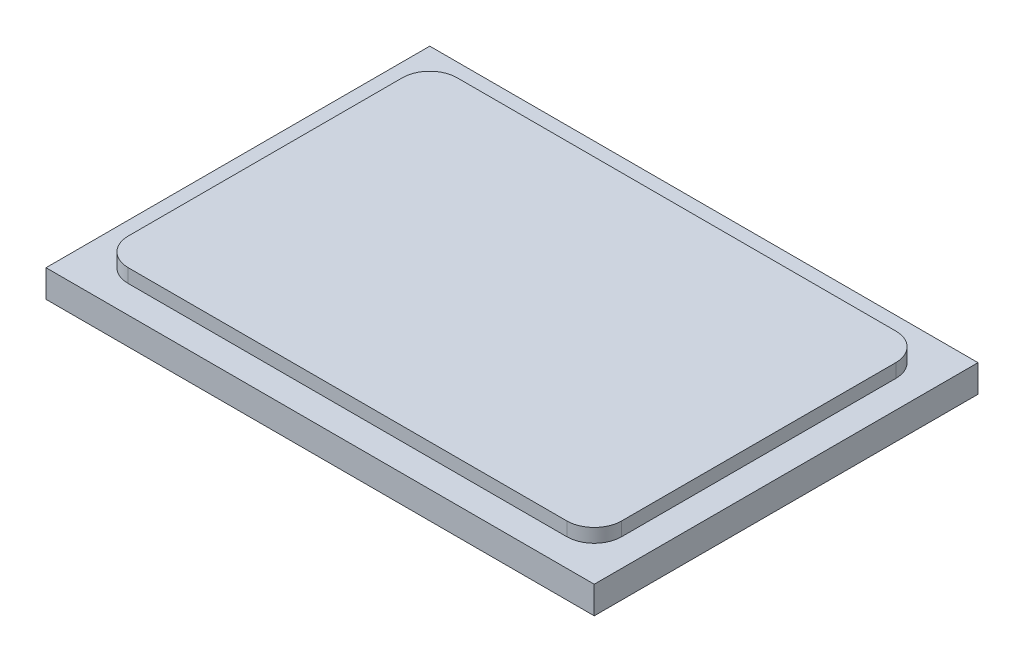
ISO-10303-21;
HEADER;
FILE_DESCRIPTION(('STEP AP214'),'2;1');
FILE_NAME('part.step','',(''),(''),'','','');
FILE_SCHEMA(('AUTOMOTIVE_DESIGN { 1 0 10303 214 1 1 1 1 }'));
ENDSEC;
DATA;
#1=APPLICATION_CONTEXT('core data for automotive mechanical design processes');
#2=APPLICATION_PROTOCOL_DEFINITION('international standard','automotive_design',2000,#1);
#3=PRODUCT_CONTEXT('',#1,'mechanical');
#4=PRODUCT('Part','Part','',(#3));
#5=PRODUCT_RELATED_PRODUCT_CATEGORY('part','',(#4));
#6=PRODUCT_DEFINITION_FORMATION('','',#4);
#7=PRODUCT_DEFINITION_CONTEXT('part definition',#1,'design');
#8=PRODUCT_DEFINITION('design','',#6,#7);
#9=PRODUCT_DEFINITION_SHAPE('','',#8);
#10=(LENGTH_UNIT() NAMED_UNIT(*) SI_UNIT(.MILLI.,.METRE.));
#11=(NAMED_UNIT(*) PLANE_ANGLE_UNIT() SI_UNIT($,.RADIAN.));
#12=(NAMED_UNIT(*) SI_UNIT($,.STERADIAN.) SOLID_ANGLE_UNIT());
#13=UNCERTAINTY_MEASURE_WITH_UNIT(LENGTH_MEASURE(1.E-05),#10,'distance_accuracy_value','');
#14=(GEOMETRIC_REPRESENTATION_CONTEXT(3) GLOBAL_UNCERTAINTY_ASSIGNED_CONTEXT((#13)) GLOBAL_UNIT_ASSIGNED_CONTEXT((#10,
#11,#12)) REPRESENTATION_CONTEXT('',''));
#15=CARTESIAN_POINT('',(0.,0.,0.));
#16=DIRECTION('',(0.,0.,1.));
#17=DIRECTION('',(1.,0.,0.));
#18=AXIS2_PLACEMENT_3D('',#15,#16,#17);
#19=CARTESIAN_POINT('',(-34.9682717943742,9.525,-18.9052133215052));
#20=DIRECTION('',(1.,0.,0.));
#21=DIRECTION('',(0.,0.,-1.));
#22=AXIS2_PLACEMENT_3D('',#19,#20,#21);
#23=PLANE('',#22);
#24=DIRECTION('',(0.,1.,0.));
#25=VECTOR('',#24,1.);
#26=CARTESIAN_POINT('',(-34.9682717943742,6.35,-12.5552133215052));
#27=LINE('',#26,#25);
#28=CARTESIAN_POINT('',(-34.9682717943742,6.35,-12.5552133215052));
#29=VERTEX_POINT('',#28);
#30=CARTESIAN_POINT('',(-34.9682717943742,9.525,-12.5552133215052));
#31=VERTEX_POINT('',#30);
#32=EDGE_CURVE('E391',#29,#31,#27,.T.);
#33=ORIENTED_EDGE('',*,*,#32,.F.);
#34=DIRECTION('',(0.,0.,1.));
#35=VECTOR('',#34,1.);
#36=CARTESIAN_POINT('',(-34.9682717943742,6.35,-18.9052133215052));
#37=LINE('',#36,#35);
#38=CARTESIAN_POINT('',(-34.9682717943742,6.35,50.9447866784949));
#39=VERTEX_POINT('',#38);
#40=EDGE_CURVE('E148',#29,#39,#37,.T.);
#41=ORIENTED_EDGE('',*,*,#40,.T.);
#42=DIRECTION('',(0.,1.,0.));
#43=VECTOR('',#42,1.);
#44=CARTESIAN_POINT('',(-34.9682717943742,6.35,50.9447866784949));
#45=LINE('',#44,#43);
#46=CARTESIAN_POINT('',(-34.9682717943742,9.525,50.9447866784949));
#47=VERTEX_POINT('',#46);
#48=EDGE_CURVE('E397',#39,#47,#45,.T.);
#49=ORIENTED_EDGE('',*,*,#48,.T.);
#50=DIRECTION('',(0.,0.,1.));
#51=VECTOR('',#50,1.);
#52=CARTESIAN_POINT('',(-34.9682717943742,9.525,-18.9052133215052));
#53=LINE('',#52,#51);
#54=EDGE_CURVE('E158',#31,#47,#53,.T.);
#55=ORIENTED_EDGE('',*,*,#54,.F.);
#56=EDGE_LOOP('',(#33,#41,#49,#55));
#57=FACE_BOUND('',#56,.T.);
#58=ADVANCED_FACE('F36',(#57),#23,.F.);
#59=CARTESIAN_POINT('',(-34.9682717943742,9.525,57.2947866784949));
#60=DIRECTION('',(0.,0.,-1.));
#61=DIRECTION('',(-1.,0.,0.));
#62=AXIS2_PLACEMENT_3D('',#59,#60,#61);
#63=PLANE('',#62);
#64=DIRECTION('',(0.,1.,0.));
#65=VECTOR('',#64,1.);
#66=CARTESIAN_POINT('',(-28.6182717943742,6.35,57.2947866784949));
#67=LINE('',#66,#65);
#68=CARTESIAN_POINT('',(-28.6182717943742,6.35,57.2947866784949));
#69=VERTEX_POINT('',#68);
#70=CARTESIAN_POINT('',(-28.6182717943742,9.525,57.2947866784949));
#71=VERTEX_POINT('',#70);
#72=EDGE_CURVE('E147',#69,#71,#67,.T.);
#73=ORIENTED_EDGE('',*,*,#72,.F.);
#74=DIRECTION('',(1.,0.,0.));
#75=VECTOR('',#74,1.);
#76=CARTESIAN_POINT('',(-34.9682717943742,6.35,57.2947866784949));
#77=LINE('',#76,#75);
#78=CARTESIAN_POINT('',(72.9817282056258,6.35,57.2947866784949));
#79=VERTEX_POINT('',#78);
#80=EDGE_CURVE('E140',#69,#79,#77,.T.);
#81=ORIENTED_EDGE('',*,*,#80,.T.);
#82=DIRECTION('',(0.,1.,0.));
#83=VECTOR('',#82,1.);
#84=CARTESIAN_POINT('',(72.9817282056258,6.35,57.2947866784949));
#85=LINE('',#84,#83);
#86=CARTESIAN_POINT('',(72.9817282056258,9.525,57.2947866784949));
#87=VERTEX_POINT('',#86);
#88=EDGE_CURVE('E123',#79,#87,#85,.T.);
#89=ORIENTED_EDGE('',*,*,#88,.T.);
#90=DIRECTION('',(1.,0.,0.));
#91=VECTOR('',#90,1.);
#92=CARTESIAN_POINT('',(-34.9682717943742,9.525,57.2947866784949));
#93=LINE('',#92,#91);
#94=EDGE_CURVE('E377',#71,#87,#93,.T.);
#95=ORIENTED_EDGE('',*,*,#94,.F.);
#96=EDGE_LOOP('',(#73,#81,#89,#95));
#97=FACE_BOUND('',#96,.T.);
#98=ADVANCED_FACE('F146',(#97),#63,.F.);
#99=CARTESIAN_POINT('',(79.3317282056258,9.525,-18.9052133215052));
#100=DIRECTION('',(-1.,0.,0.));
#101=DIRECTION('',(0.,0.,1.));
#102=AXIS2_PLACEMENT_3D('',#99,#100,#101);
#103=PLANE('',#102);
#104=DIRECTION('',(0.,1.,0.));
#105=VECTOR('',#104,1.);
#106=CARTESIAN_POINT('',(79.3317282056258,6.35,50.9447866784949));
#107=LINE('',#106,#105);
#108=CARTESIAN_POINT('',(79.3317282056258,6.35,50.9447866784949));
#109=VERTEX_POINT('',#108);
#110=CARTESIAN_POINT('',(79.3317282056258,9.525,50.9447866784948));
#111=VERTEX_POINT('',#110);
#112=EDGE_CURVE('E59',#109,#111,#107,.T.);
#113=ORIENTED_EDGE('',*,*,#112,.F.);
#114=DIRECTION('',(0.,0.,-1.));
#115=VECTOR('',#114,1.);
#116=CARTESIAN_POINT('',(79.3317282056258,6.35,-18.9052133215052));
#117=LINE('',#116,#115);
#118=CARTESIAN_POINT('',(79.3317282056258,6.35,-12.5552133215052));
#119=VERTEX_POINT('',#118);
#120=EDGE_CURVE('E143',#109,#119,#117,.T.);
#121=ORIENTED_EDGE('',*,*,#120,.T.);
#122=DIRECTION('',(0.,1.,0.));
#123=VECTOR('',#122,1.);
#124=CARTESIAN_POINT('',(79.3317282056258,6.35,-12.5552133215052));
#125=LINE('',#124,#123);
#126=CARTESIAN_POINT('',(79.3317282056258,9.525,-12.5552133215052));
#127=VERTEX_POINT('',#126);
#128=EDGE_CURVE('E382',#119,#127,#125,.T.);
#129=ORIENTED_EDGE('',*,*,#128,.T.);
#130=DIRECTION('',(0.,0.,-1.));
#131=VECTOR('',#130,1.);
#132=CARTESIAN_POINT('',(79.3317282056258,9.525,-18.9052133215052));
#133=LINE('',#132,#131);
#134=EDGE_CURVE('E376',#111,#127,#133,.T.);
#135=ORIENTED_EDGE('',*,*,#134,.F.);
#136=EDGE_LOOP('',(#113,#121,#129,#135));
#137=FACE_BOUND('',#136,.T.);
#138=ADVANCED_FACE('F216',(#137),#103,.F.);
#139=CARTESIAN_POINT('',(-34.9682717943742,9.525,-18.9052133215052));
#140=DIRECTION('',(0.,0.,1.));
#141=DIRECTION('',(1.,0.,0.));
#142=AXIS2_PLACEMENT_3D('',#139,#140,#141);
#143=PLANE('',#142);
#144=DIRECTION('',(-1.,0.,0.));
#145=VECTOR('',#144,1.);
#146=CARTESIAN_POINT('',(-34.9682717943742,6.35,-18.9052133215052));
#147=LINE('',#146,#145);
#148=CARTESIAN_POINT('',(72.9817282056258,6.35,-18.9052133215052));
#149=VERTEX_POINT('',#148);
#150=CARTESIAN_POINT('',(-28.6182717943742,6.35,-18.9052133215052));
#151=VERTEX_POINT('',#150);
#152=EDGE_CURVE('E150',#149,#151,#147,.T.);
#153=ORIENTED_EDGE('',*,*,#152,.T.);
#154=DIRECTION('',(0.,1.,0.));
#155=VECTOR('',#154,1.);
#156=CARTESIAN_POINT('',(-28.6182717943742,6.35,-18.9052133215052));
#157=LINE('',#156,#155);
#158=CARTESIAN_POINT('',(-28.6182717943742,9.525,-18.9052133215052));
#159=VERTEX_POINT('',#158);
#160=EDGE_CURVE('E389',#151,#159,#157,.T.);
#161=ORIENTED_EDGE('',*,*,#160,.T.);
#162=DIRECTION('',(-1.,0.,0.));
#163=VECTOR('',#162,1.);
#164=CARTESIAN_POINT('',(-34.9682717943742,9.525,-18.9052133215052));
#165=LINE('',#164,#163);
#166=CARTESIAN_POINT('',(72.9817282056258,9.525,-18.9052133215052));
#167=VERTEX_POINT('',#166);
#168=EDGE_CURVE('E174',#167,#159,#165,.T.);
#169=ORIENTED_EDGE('',*,*,#168,.F.);
#170=DIRECTION('',(0.,1.,0.));
#171=VECTOR('',#170,1.);
#172=CARTESIAN_POINT('',(72.9817282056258,6.35,-18.9052133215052));
#173=LINE('',#172,#171);
#174=EDGE_CURVE('E51',#149,#167,#173,.T.);
#175=ORIENTED_EDGE('',*,*,#174,.F.);
#176=EDGE_LOOP('',(#153,#161,#169,#175));
#177=FACE_BOUND('',#176,.T.);
#178=ADVANCED_FACE('F309',(#177),#143,.F.);
#179=CARTESIAN_POINT('',(0.,9.525,0.));
#180=DIRECTION('',(0.,1.,0.));
#181=DIRECTION('',(0.,0.,1.));
#182=AXIS2_PLACEMENT_3D('',#179,#180,#181);
#183=PLANE('',#182);
#184=ORIENTED_EDGE('',*,*,#168,.T.);
#185=CARTESIAN_POINT('',(-28.6182717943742,9.525,-12.5552133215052));
#186=DIRECTION('',(0.,1.,0.));
#187=DIRECTION('',(0.,0.,1.));
#188=AXIS2_PLACEMENT_3D('',#185,#186,#187);
#189=CIRCLE('',#188,6.35);
#190=EDGE_CURVE('E371',#159,#31,#189,.T.);
#191=ORIENTED_EDGE('',*,*,#190,.T.);
#192=ORIENTED_EDGE('',*,*,#54,.T.);
#193=CARTESIAN_POINT('',(-28.6182717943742,9.525,50.9447866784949));
#194=DIRECTION('',(0.,1.,0.));
#195=DIRECTION('',(0.,0.,1.));
#196=AXIS2_PLACEMENT_3D('',#193,#194,#195);
#197=CIRCLE('',#196,6.35);
#198=EDGE_CURVE('E394',#47,#71,#197,.T.);
#199=ORIENTED_EDGE('',*,*,#198,.T.);
#200=ORIENTED_EDGE('',*,*,#94,.T.);
#201=CARTESIAN_POINT('',(72.9817282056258,9.525,50.9447866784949));
#202=DIRECTION('',(0.,1.,0.));
#203=DIRECTION('',(0.,0.,1.));
#204=AXIS2_PLACEMENT_3D('',#201,#202,#203);
#205=CIRCLE('',#204,6.35);
#206=EDGE_CURVE('E127',#87,#111,#205,.T.);
#207=ORIENTED_EDGE('',*,*,#206,.T.);
#208=ORIENTED_EDGE('',*,*,#134,.T.);
#209=CARTESIAN_POINT('',(72.9817282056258,9.525,-12.5552133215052));
#210=DIRECTION('',(0.,1.,0.));
#211=DIRECTION('',(0.,0.,1.));
#212=AXIS2_PLACEMENT_3D('',#209,#210,#211);
#213=CIRCLE('',#212,6.35);
#214=EDGE_CURVE('E374',#127,#167,#213,.T.);
#215=ORIENTED_EDGE('',*,*,#214,.T.);
#216=EDGE_LOOP('',(#184,#191,#192,#199,#200,#207,#208,#215));
#217=FACE_BOUND('',#216,.T.);
#218=ADVANCED_FACE('F209',(#217),#183,.T.);
#219=CARTESIAN_POINT('',(-41.3182717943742,6.35,-25.2552133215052));
#220=DIRECTION('',(1.,0.,0.));
#221=DIRECTION('',(0.,0.,-1.));
#222=AXIS2_PLACEMENT_3D('',#219,#220,#221);
#223=PLANE('',#222);
#224=DIRECTION('',(0.,0.,1.));
#225=VECTOR('',#224,1.);
#226=CARTESIAN_POINT('',(-41.3182717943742,0.,-25.2552133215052));
#227=LINE('',#226,#225);
#228=CARTESIAN_POINT('',(-41.3182717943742,0.,-25.2552133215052));
#229=VERTEX_POINT('',#228);
#230=CARTESIAN_POINT('',(-41.3182717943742,0.,63.6447866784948));
#231=VERTEX_POINT('',#230);
#232=EDGE_CURVE('E170',#229,#231,#227,.T.);
#233=ORIENTED_EDGE('',*,*,#232,.T.);
#234=DIRECTION('',(0.,-1.,0.));
#235=VECTOR('',#234,1.);
#236=CARTESIAN_POINT('',(-41.3182717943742,6.35,63.6447866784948));
#237=LINE('',#236,#235);
#238=CARTESIAN_POINT('',(-41.3182717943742,6.35,63.6447866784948));
#239=VERTEX_POINT('',#238);
#240=EDGE_CURVE('E11',#239,#231,#237,.T.);
#241=ORIENTED_EDGE('',*,*,#240,.F.);
#242=DIRECTION('',(0.,0.,1.));
#243=VECTOR('',#242,1.);
#244=CARTESIAN_POINT('',(-41.3182717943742,6.35,-25.2552133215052));
#245=LINE('',#244,#243);
#246=CARTESIAN_POINT('',(-41.3182717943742,6.35,-25.2552133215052));
#247=VERTEX_POINT('',#246);
#248=EDGE_CURVE('E159',#247,#239,#245,.T.);
#249=ORIENTED_EDGE('',*,*,#248,.F.);
#250=DIRECTION('',(0.,-1.,0.));
#251=VECTOR('',#250,1.);
#252=CARTESIAN_POINT('',(-41.3182717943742,6.35,-25.2552133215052));
#253=LINE('',#252,#251);
#254=EDGE_CURVE('E169',#247,#229,#253,.T.);
#255=ORIENTED_EDGE('',*,*,#254,.T.);
#256=EDGE_LOOP('',(#233,#241,#249,#255));
#257=FACE_BOUND('',#256,.T.);
#258=ADVANCED_FACE('F38',(#257),#223,.F.);
#259=CARTESIAN_POINT('',(-41.3182717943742,6.35,63.6447866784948));
#260=DIRECTION('',(0.,0.,-1.));
#261=DIRECTION('',(-1.,0.,0.));
#262=AXIS2_PLACEMENT_3D('',#259,#260,#261);
#263=PLANE('',#262);
#264=DIRECTION('',(1.,0.,0.));
#265=VECTOR('',#264,1.);
#266=CARTESIAN_POINT('',(-41.3182717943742,0.,63.6447866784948));
#267=LINE('',#266,#265);
#268=CARTESIAN_POINT('',(85.6817282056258,0.,63.6447866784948));
#269=VERTEX_POINT('',#268);
#270=EDGE_CURVE('E173',#231,#269,#267,.T.);
#271=ORIENTED_EDGE('',*,*,#270,.T.);
#272=DIRECTION('',(0.,-1.,0.));
#273=VECTOR('',#272,1.);
#274=CARTESIAN_POINT('',(85.6817282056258,6.35,63.6447866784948));
#275=LINE('',#274,#273);
#276=CARTESIAN_POINT('',(85.6817282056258,6.35,63.6447866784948));
#277=VERTEX_POINT('',#276);
#278=EDGE_CURVE('E44',#277,#269,#275,.T.);
#279=ORIENTED_EDGE('',*,*,#278,.F.);
#280=DIRECTION('',(1.,0.,0.));
#281=VECTOR('',#280,1.);
#282=CARTESIAN_POINT('',(-41.3182717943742,6.35,63.6447866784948));
#283=LINE('',#282,#281);
#284=EDGE_CURVE('E162',#239,#277,#283,.T.);
#285=ORIENTED_EDGE('',*,*,#284,.F.);
#286=ORIENTED_EDGE('',*,*,#240,.T.);
#287=EDGE_LOOP('',(#271,#279,#285,#286));
#288=FACE_BOUND('',#287,.T.);
#289=ADVANCED_FACE('F202',(#288),#263,.F.);
#290=CARTESIAN_POINT('',(85.6817282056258,6.35,-25.2552133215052));
#291=DIRECTION('',(-1.,0.,0.));
#292=DIRECTION('',(0.,0.,1.));
#293=AXIS2_PLACEMENT_3D('',#290,#291,#292);
#294=PLANE('',#293);
#295=DIRECTION('',(0.,0.,-1.));
#296=VECTOR('',#295,1.);
#297=CARTESIAN_POINT('',(85.6817282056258,0.,-25.2552133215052));
#298=LINE('',#297,#296);
#299=CARTESIAN_POINT('',(85.6817282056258,0.,-25.2552133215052));
#300=VERTEX_POINT('',#299);
#301=EDGE_CURVE('E176',#269,#300,#298,.T.);
#302=ORIENTED_EDGE('',*,*,#301,.T.);
#303=DIRECTION('',(0.,-1.,0.));
#304=VECTOR('',#303,1.);
#305=CARTESIAN_POINT('',(85.6817282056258,6.35,-25.2552133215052));
#306=LINE('',#305,#304);
#307=CARTESIAN_POINT('',(85.6817282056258,6.35,-25.2552133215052));
#308=VERTEX_POINT('',#307);
#309=EDGE_CURVE('E181',#308,#300,#306,.T.);
#310=ORIENTED_EDGE('',*,*,#309,.F.);
#311=DIRECTION('',(0.,0.,-1.));
#312=VECTOR('',#311,1.);
#313=CARTESIAN_POINT('',(85.6817282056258,6.35,-25.2552133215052));
#314=LINE('',#313,#312);
#315=EDGE_CURVE('E165',#277,#308,#314,.T.);
#316=ORIENTED_EDGE('',*,*,#315,.F.);
#317=ORIENTED_EDGE('',*,*,#278,.T.);
#318=EDGE_LOOP('',(#302,#310,#316,#317));
#319=FACE_BOUND('',#318,.T.);
#320=ADVANCED_FACE('F188',(#319),#294,.F.);
#321=CARTESIAN_POINT('',(-41.3182717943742,6.35,-25.2552133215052));
#322=DIRECTION('',(0.,0.,1.));
#323=DIRECTION('',(1.,0.,0.));
#324=AXIS2_PLACEMENT_3D('',#321,#322,#323);
#325=PLANE('',#324);
#326=DIRECTION('',(-1.,0.,0.));
#327=VECTOR('',#326,1.);
#328=CARTESIAN_POINT('',(-41.3182717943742,0.,-25.2552133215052));
#329=LINE('',#328,#327);
#330=EDGE_CURVE('E163',#300,#229,#329,.T.);
#331=ORIENTED_EDGE('',*,*,#330,.T.);
#332=ORIENTED_EDGE('',*,*,#254,.F.);
#333=DIRECTION('',(-1.,0.,0.));
#334=VECTOR('',#333,1.);
#335=CARTESIAN_POINT('',(-41.3182717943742,6.35,-25.2552133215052));
#336=LINE('',#335,#334);
#337=EDGE_CURVE('E167',#308,#247,#336,.T.);
#338=ORIENTED_EDGE('',*,*,#337,.F.);
#339=ORIENTED_EDGE('',*,*,#309,.T.);
#340=EDGE_LOOP('',(#331,#332,#338,#339));
#341=FACE_BOUND('',#340,.T.);
#342=ADVANCED_FACE('F197',(#341),#325,.F.);
#343=CARTESIAN_POINT('',(0.,6.35,0.));
#344=DIRECTION('',(0.,1.,0.));
#345=DIRECTION('',(0.,0.,1.));
#346=AXIS2_PLACEMENT_3D('',#343,#344,#345);
#347=PLANE('',#346);
#348=ORIENTED_EDGE('',*,*,#40,.F.);
#349=CARTESIAN_POINT('',(-28.6182717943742,6.35,-12.5552133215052));
#350=DIRECTION('',(0.,1.,0.));
#351=DIRECTION('',(0.,0.,1.));
#352=AXIS2_PLACEMENT_3D('',#349,#350,#351);
#353=CIRCLE('',#352,6.35);
#354=EDGE_CURVE('E392',#151,#29,#353,.T.);
#355=ORIENTED_EDGE('',*,*,#354,.F.);
#356=ORIENTED_EDGE('',*,*,#152,.F.);
#357=CARTESIAN_POINT('',(72.9817282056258,6.35,-12.5552133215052));
#358=DIRECTION('',(0.,1.,0.));
#359=DIRECTION('',(0.,0.,1.));
#360=AXIS2_PLACEMENT_3D('',#357,#358,#359);
#361=CIRCLE('',#360,6.35);
#362=EDGE_CURVE('E385',#119,#149,#361,.T.);
#363=ORIENTED_EDGE('',*,*,#362,.F.);
#364=ORIENTED_EDGE('',*,*,#120,.F.);
#365=CARTESIAN_POINT('',(72.9817282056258,6.35,50.9447866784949));
#366=DIRECTION('',(0.,1.,0.));
#367=DIRECTION('',(0.,0.,1.));
#368=AXIS2_PLACEMENT_3D('',#365,#366,#367);
#369=CIRCLE('',#368,6.35);
#370=EDGE_CURVE('E126',#79,#109,#369,.T.);
#371=ORIENTED_EDGE('',*,*,#370,.F.);
#372=ORIENTED_EDGE('',*,*,#80,.F.);
#373=CARTESIAN_POINT('',(-28.6182717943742,6.35,50.9447866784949));
#374=DIRECTION('',(0.,1.,0.));
#375=DIRECTION('',(0.,0.,1.));
#376=AXIS2_PLACEMENT_3D('',#373,#374,#375);
#377=CIRCLE('',#376,6.35);
#378=EDGE_CURVE('E400',#39,#69,#377,.T.);
#379=ORIENTED_EDGE('',*,*,#378,.F.);
#380=EDGE_LOOP('',(#348,#355,#356,#363,#364,#371,#372,#379));
#381=FACE_BOUND('',#380,.T.);
#382=ORIENTED_EDGE('',*,*,#248,.T.);
#383=ORIENTED_EDGE('',*,*,#284,.T.);
#384=ORIENTED_EDGE('',*,*,#315,.T.);
#385=ORIENTED_EDGE('',*,*,#337,.T.);
#386=EDGE_LOOP('',(#382,#383,#384,#385));
#387=FACE_BOUND('',#386,.T.);
#388=ADVANCED_FACE('F137',(#381,#387),#347,.T.);
#389=CARTESIAN_POINT('',(0.,0.,0.));
#390=DIRECTION('',(0.,1.,0.));
#391=DIRECTION('',(0.,0.,1.));
#392=AXIS2_PLACEMENT_3D('',#389,#390,#391);
#393=PLANE('',#392);
#394=ORIENTED_EDGE('',*,*,#232,.F.);
#395=ORIENTED_EDGE('',*,*,#330,.F.);
#396=ORIENTED_EDGE('',*,*,#301,.F.);
#397=ORIENTED_EDGE('',*,*,#270,.F.);
#398=EDGE_LOOP('',(#394,#395,#396,#397));
#399=FACE_BOUND('',#398,.T.);
#400=ADVANCED_FACE('F194',(#399),#393,.F.);
#401=CARTESIAN_POINT('',(72.9817282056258,6.35,-12.5552133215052));
#402=DIRECTION('',(0.,1.,0.));
#403=DIRECTION('',(0.,0.,1.));
#404=AXIS2_PLACEMENT_3D('',#401,#402,#403);
#405=CYLINDRICAL_SURFACE('',#404,6.35);
#406=ORIENTED_EDGE('',*,*,#214,.F.);
#407=ORIENTED_EDGE('',*,*,#128,.F.);
#408=ORIENTED_EDGE('',*,*,#362,.T.);
#409=ORIENTED_EDGE('',*,*,#174,.T.);
#410=EDGE_LOOP('',(#406,#407,#408,#409));
#411=FACE_BOUND('',#410,.T.);
#412=ADVANCED_FACE('F225',(#411),#405,.T.);
#413=CARTESIAN_POINT('',(72.9817282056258,6.35,50.9447866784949));
#414=DIRECTION('',(0.,1.,0.));
#415=DIRECTION('',(0.,0.,1.));
#416=AXIS2_PLACEMENT_3D('',#413,#414,#415);
#417=CYLINDRICAL_SURFACE('',#416,6.35);
#418=ORIENTED_EDGE('',*,*,#206,.F.);
#419=ORIENTED_EDGE('',*,*,#88,.F.);
#420=ORIENTED_EDGE('',*,*,#370,.T.);
#421=ORIENTED_EDGE('',*,*,#112,.T.);
#422=EDGE_LOOP('',(#418,#419,#420,#421));
#423=FACE_BOUND('',#422,.T.);
#424=ADVANCED_FACE('F125',(#423),#417,.T.);
#425=CARTESIAN_POINT('',(-28.6182717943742,6.35,50.9447866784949));
#426=DIRECTION('',(0.,1.,0.));
#427=DIRECTION('',(0.,0.,1.));
#428=AXIS2_PLACEMENT_3D('',#425,#426,#427);
#429=CYLINDRICAL_SURFACE('',#428,6.35);
#430=ORIENTED_EDGE('',*,*,#198,.F.);
#431=ORIENTED_EDGE('',*,*,#48,.F.);
#432=ORIENTED_EDGE('',*,*,#378,.T.);
#433=ORIENTED_EDGE('',*,*,#72,.T.);
#434=EDGE_LOOP('',(#430,#431,#432,#433));
#435=FACE_BOUND('',#434,.T.);
#436=ADVANCED_FACE('F252',(#435),#429,.T.);
#437=CARTESIAN_POINT('',(-28.6182717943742,6.35,-12.5552133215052));
#438=DIRECTION('',(0.,1.,0.));
#439=DIRECTION('',(0.,0.,1.));
#440=AXIS2_PLACEMENT_3D('',#437,#438,#439);
#441=CYLINDRICAL_SURFACE('',#440,6.35);
#442=ORIENTED_EDGE('',*,*,#190,.F.);
#443=ORIENTED_EDGE('',*,*,#160,.F.);
#444=ORIENTED_EDGE('',*,*,#354,.T.);
#445=ORIENTED_EDGE('',*,*,#32,.T.);
#446=EDGE_LOOP('',(#442,#443,#444,#445));
#447=FACE_BOUND('',#446,.T.);
#448=ADVANCED_FACE('F259',(#447),#441,.T.);
#449=CLOSED_SHELL('',(#58,#98,#138,#178,#218,#258,#289,#320,#342,#388,#400,#412,#424,#436,#448));
#450=MANIFOLD_SOLID_BREP('B2',#449);
#451=ADVANCED_BREP_SHAPE_REPRESENTATION('',(#18,#450),#14);
#452=SHAPE_DEFINITION_REPRESENTATION(#9,#451);
ENDSEC;
END-ISO-10303-21;
